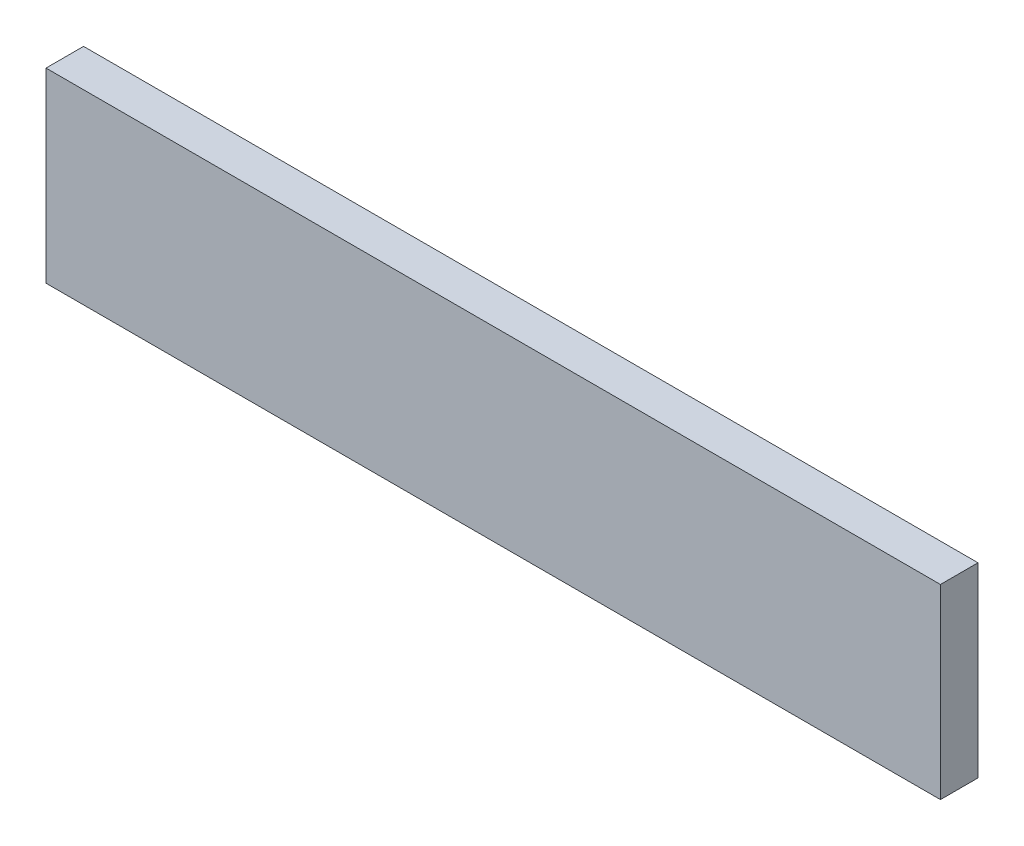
ISO-10303-21;
HEADER;
FILE_DESCRIPTION(('STEP AP214'),'2;1');
FILE_NAME('part.step','',(''),(''),'','','');
FILE_SCHEMA(('AUTOMOTIVE_DESIGN { 1 0 10303 214 1 1 1 1 }'));
ENDSEC;
DATA;
#1=APPLICATION_CONTEXT('core data for automotive mechanical design processes');
#2=APPLICATION_PROTOCOL_DEFINITION('international standard','automotive_design',2000,#1);
#3=PRODUCT_CONTEXT('',#1,'mechanical');
#4=PRODUCT('Part','Part','',(#3));
#5=PRODUCT_RELATED_PRODUCT_CATEGORY('part','',(#4));
#6=PRODUCT_DEFINITION_FORMATION('','',#4);
#7=PRODUCT_DEFINITION_CONTEXT('part definition',#1,'design');
#8=PRODUCT_DEFINITION('design','',#6,#7);
#9=PRODUCT_DEFINITION_SHAPE('','',#8);
#10=(LENGTH_UNIT() NAMED_UNIT(*) SI_UNIT(.MILLI.,.METRE.));
#11=(NAMED_UNIT(*) PLANE_ANGLE_UNIT() SI_UNIT($,.RADIAN.));
#12=(NAMED_UNIT(*) SI_UNIT($,.STERADIAN.) SOLID_ANGLE_UNIT());
#13=UNCERTAINTY_MEASURE_WITH_UNIT(LENGTH_MEASURE(1.E-05),#10,'distance_accuracy_value','');
#14=(GEOMETRIC_REPRESENTATION_CONTEXT(3) GLOBAL_UNCERTAINTY_ASSIGNED_CONTEXT((#13)) GLOBAL_UNIT_ASSIGNED_CONTEXT((#10,
#11,#12)) REPRESENTATION_CONTEXT('',''));
#15=CARTESIAN_POINT('',(0.,0.,0.));
#16=DIRECTION('',(0.,0.,1.));
#17=DIRECTION('',(1.,0.,0.));
#18=AXIS2_PLACEMENT_3D('',#15,#16,#17);
#19=CARTESIAN_POINT('',(0.,0.,6.4));
#20=DIRECTION('',(0.,0.,-1.));
#21=DIRECTION('',(-1.,0.,0.));
#22=AXIS2_PLACEMENT_3D('',#19,#20,#21);
#23=PLANE('',#22);
#24=DIRECTION('',(1.,0.,0.));
#25=VECTOR('',#24,1.);
#26=CARTESIAN_POINT('',(-76.2,15.875,6.4));
#27=LINE('',#26,#25);
#28=CARTESIAN_POINT('',(-76.2,15.875,6.4));
#29=VERTEX_POINT('',#28);
#30=CARTESIAN_POINT('',(76.2,15.875,6.4));
#31=VERTEX_POINT('',#30);
#32=EDGE_CURVE('E68',#29,#31,#27,.T.);
#33=ORIENTED_EDGE('',*,*,#32,.F.);
#34=DIRECTION('',(0.,1.,0.));
#35=VECTOR('',#34,1.);
#36=CARTESIAN_POINT('',(-76.2,-15.875,6.4));
#37=LINE('',#36,#35);
#38=CARTESIAN_POINT('',(-76.2,-15.875,6.4));
#39=VERTEX_POINT('',#38);
#40=EDGE_CURVE('E76',#39,#29,#37,.T.);
#41=ORIENTED_EDGE('',*,*,#40,.F.);
#42=DIRECTION('',(-1.,0.,0.));
#43=VECTOR('',#42,1.);
#44=CARTESIAN_POINT('',(76.2,-15.875,6.4));
#45=LINE('',#44,#43);
#46=CARTESIAN_POINT('',(76.2,-15.875,6.4));
#47=VERTEX_POINT('',#46);
#48=EDGE_CURVE('E70',#47,#39,#45,.T.);
#49=ORIENTED_EDGE('',*,*,#48,.F.);
#50=DIRECTION('',(0.,-1.,0.));
#51=VECTOR('',#50,1.);
#52=CARTESIAN_POINT('',(76.2,15.875,6.4));
#53=LINE('',#52,#51);
#54=EDGE_CURVE('E57',#31,#47,#53,.T.);
#55=ORIENTED_EDGE('',*,*,#54,.F.);
#56=EDGE_LOOP('',(#33,#41,#49,#55));
#57=FACE_BOUND('',#56,.T.);
#58=ADVANCED_FACE('F14',(#57),#23,.F.);
#59=CARTESIAN_POINT('',(76.2,-15.875,1.5875));
#60=DIRECTION('',(0.,-1.,0.));
#61=DIRECTION('',(1.,0.,0.));
#62=AXIS2_PLACEMENT_3D('',#59,#60,#61);
#63=PLANE('',#62);
#64=ORIENTED_EDGE('',*,*,#48,.T.);
#65=DIRECTION('',(0.,0.,1.));
#66=VECTOR('',#65,1.);
#67=CARTESIAN_POINT('',(-76.2,-15.875,1.5875));
#68=LINE('',#67,#66);
#69=CARTESIAN_POINT('',(-76.2,-15.875,0.));
#70=VERTEX_POINT('',#69);
#71=EDGE_CURVE('E39',#70,#39,#68,.T.);
#72=ORIENTED_EDGE('',*,*,#71,.F.);
#73=DIRECTION('',(1.,0.,0.));
#74=VECTOR('',#73,1.);
#75=CARTESIAN_POINT('',(-76.2,-15.875,0.));
#76=LINE('',#75,#74);
#77=CARTESIAN_POINT('',(76.2,-15.875,0.));
#78=VERTEX_POINT('',#77);
#79=EDGE_CURVE('E18',#70,#78,#76,.T.);
#80=ORIENTED_EDGE('',*,*,#79,.T.);
#81=DIRECTION('',(0.,0.,1.));
#82=VECTOR('',#81,1.);
#83=CARTESIAN_POINT('',(76.2,-15.875,1.5875));
#84=LINE('',#83,#82);
#85=EDGE_CURVE('E31',#78,#47,#84,.T.);
#86=ORIENTED_EDGE('',*,*,#85,.T.);
#87=EDGE_LOOP('',(#64,#72,#80,#86));
#88=FACE_BOUND('',#87,.T.);
#89=ADVANCED_FACE('F86',(#88),#63,.T.);
#90=CARTESIAN_POINT('',(76.2,15.875,1.5875));
#91=DIRECTION('',(1.,0.,0.));
#92=DIRECTION('',(0.,1.,0.));
#93=AXIS2_PLACEMENT_3D('',#90,#91,#92);
#94=PLANE('',#93);
#95=DIRECTION('',(0.,0.,1.));
#96=VECTOR('',#95,1.);
#97=CARTESIAN_POINT('',(76.2,15.875,1.5875));
#98=LINE('',#97,#96);
#99=CARTESIAN_POINT('',(76.2,15.875,0.));
#100=VERTEX_POINT('',#99);
#101=EDGE_CURVE('E23',#100,#31,#98,.T.);
#102=ORIENTED_EDGE('',*,*,#101,.T.);
#103=ORIENTED_EDGE('',*,*,#54,.T.);
#104=ORIENTED_EDGE('',*,*,#85,.F.);
#105=DIRECTION('',(0.,1.,0.));
#106=VECTOR('',#105,1.);
#107=CARTESIAN_POINT('',(76.2,15.875,0.));
#108=LINE('',#107,#106);
#109=EDGE_CURVE('E58',#78,#100,#108,.T.);
#110=ORIENTED_EDGE('',*,*,#109,.T.);
#111=EDGE_LOOP('',(#102,#103,#104,#110));
#112=FACE_BOUND('',#111,.T.);
#113=ADVANCED_FACE('F56',(#112),#94,.T.);
#114=CARTESIAN_POINT('',(-76.2,15.875,1.5875));
#115=DIRECTION('',(0.,1.,0.));
#116=DIRECTION('',(-1.,0.,0.));
#117=AXIS2_PLACEMENT_3D('',#114,#115,#116);
#118=PLANE('',#117);
#119=DIRECTION('',(0.,0.,1.));
#120=VECTOR('',#119,1.);
#121=CARTESIAN_POINT('',(-76.2,15.875,1.5875));
#122=LINE('',#121,#120);
#123=CARTESIAN_POINT('',(-76.2,15.875,0.));
#124=VERTEX_POINT('',#123);
#125=EDGE_CURVE('E9',#124,#29,#122,.T.);
#126=ORIENTED_EDGE('',*,*,#125,.T.);
#127=ORIENTED_EDGE('',*,*,#32,.T.);
#128=ORIENTED_EDGE('',*,*,#101,.F.);
#129=DIRECTION('',(-1.,0.,0.));
#130=VECTOR('',#129,1.);
#131=CARTESIAN_POINT('',(-76.2,15.875,0.));
#132=LINE('',#131,#130);
#133=EDGE_CURVE('E81',#100,#124,#132,.T.);
#134=ORIENTED_EDGE('',*,*,#133,.T.);
#135=EDGE_LOOP('',(#126,#127,#128,#134));
#136=FACE_BOUND('',#135,.T.);
#137=ADVANCED_FACE('F72',(#136),#118,.T.);
#138=CARTESIAN_POINT('',(-76.2,-15.875,1.5875));
#139=DIRECTION('',(-1.,0.,0.));
#140=DIRECTION('',(0.,-1.,0.));
#141=AXIS2_PLACEMENT_3D('',#138,#139,#140);
#142=PLANE('',#141);
#143=ORIENTED_EDGE('',*,*,#71,.T.);
#144=ORIENTED_EDGE('',*,*,#40,.T.);
#145=ORIENTED_EDGE('',*,*,#125,.F.);
#146=DIRECTION('',(0.,-1.,0.));
#147=VECTOR('',#146,1.);
#148=CARTESIAN_POINT('',(-76.2,15.875,0.));
#149=LINE('',#148,#147);
#150=EDGE_CURVE('E82',#124,#70,#149,.T.);
#151=ORIENTED_EDGE('',*,*,#150,.T.);
#152=EDGE_LOOP('',(#143,#144,#145,#151));
#153=FACE_BOUND('',#152,.T.);
#154=ADVANCED_FACE('F89',(#153),#142,.T.);
#155=CARTESIAN_POINT('',(0.,0.,0.));
#156=DIRECTION('',(0.,0.,1.));
#157=DIRECTION('',(0.,-1.,0.));
#158=AXIS2_PLACEMENT_3D('',#155,#156,#157);
#159=PLANE('',#158);
#160=ORIENTED_EDGE('',*,*,#109,.F.);
#161=ORIENTED_EDGE('',*,*,#79,.F.);
#162=ORIENTED_EDGE('',*,*,#150,.F.);
#163=ORIENTED_EDGE('',*,*,#133,.F.);
#164=EDGE_LOOP('',(#160,#161,#162,#163));
#165=FACE_BOUND('',#164,.T.);
#166=ADVANCED_FACE('F16',(#165),#159,.F.);
#167=CLOSED_SHELL('',(#58,#89,#113,#137,#154,#166));
#168=MANIFOLD_SOLID_BREP('B1',#167);
#169=ADVANCED_BREP_SHAPE_REPRESENTATION('',(#18,#168),#14);
#170=SHAPE_DEFINITION_REPRESENTATION(#9,#169);
ENDSEC;
END-ISO-10303-21;
